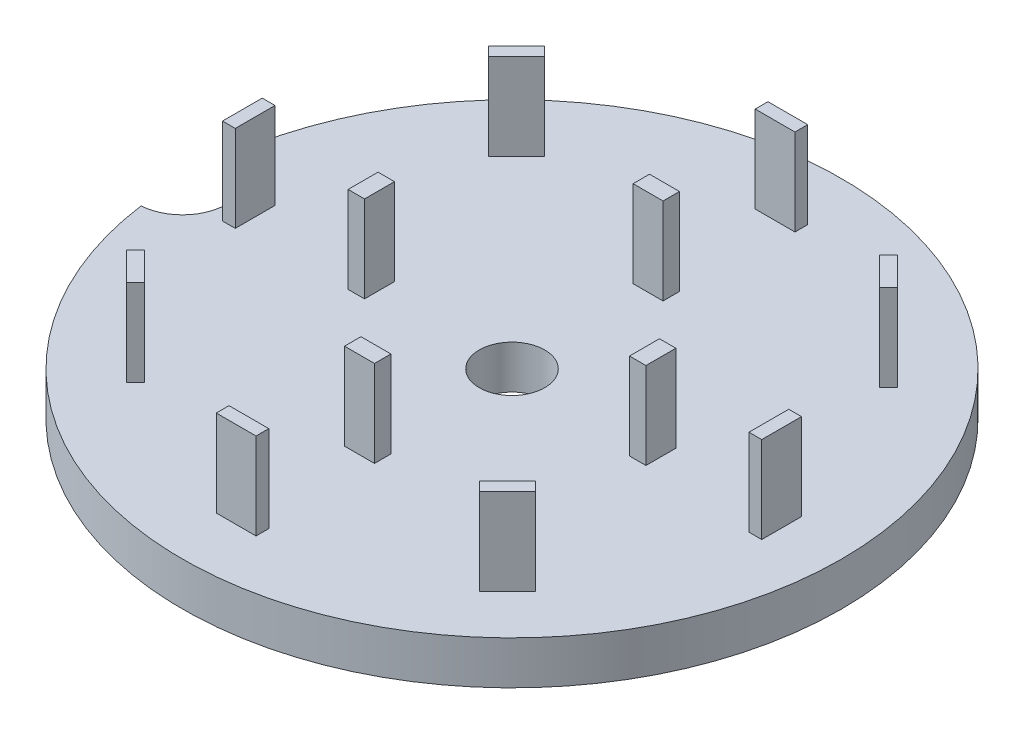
from build123d import *

# Parameters (mm, degrees)
BOSS_EXTRUDE1_DEPTH = 2
SKETCH2_R           = 1.512709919
CUT_EXTRUDE1_DEPTH  = 2
SKETCH3_W           = 0.758589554
SKETCH3_H           = 1.383310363
SKETCH3_W_2         = 1.383310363
SKETCH3_H_2         = 0.758589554
SKETCH3_W_3         = 1.836786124
SKETCH3_H_3         = 0.589442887
SKETCH3_W_4         = 0.589442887
SKETCH3_H_4         = 1.836786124
BOSS_EXTRUDE2_DEPTH = 4


with BuildPart() as part:
    # Sketch1 → Boss-Extrude1 (new body)
    with BuildSketch(Plane(origin=(0, 0, 0), x_dir=(1, 0, 0), z_dir=(0, 1, 0))):
        with BuildLine():
            ThreePointArc((-15.08391484, -2.049555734), (15.222521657, 0), (-15.08391484, 2.049555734))
            ThreePointArc((-15.08391484, 2.049555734), (-13.168284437, 0), (-15.08391484, -2.049555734))
        make_face()
    extrude(amount=BOSS_EXTRUDE1_DEPTH)

    # Sketch2 → Cut-Extrude1 (cut)
    with BuildSketch(Plane(origin=(0, 2, 0), x_dir=(-1, 0, 0), z_dir=(0, 1, 0))):
        with Locations(Location((0, 0, 0), (0, 0, 90))):
            Circle(SKETCH2_R)
    extrude(amount=-CUT_EXTRUDE1_DEPTH, mode=Mode.SUBTRACT)

    # Sketch3 → Boss-Extrude2 (add)
    with BuildSketch(Plane(origin=(0, 2, 0), x_dir=(-1, 0, 0), z_dir=(0, 1, 0))):
        with Locations((-6.581879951, 0.082786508)):
            Rectangle(SKETCH3_W, SKETCH3_H)
        with Locations((-0.082786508, -6.581879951)):
            Rectangle(SKETCH3_W_2, SKETCH3_H_2)
        with Locations((0.082786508, 6.581879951)):
            Rectangle(SKETCH3_W_2, SKETCH3_H_2)
        with Locations((6.581879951, -0.082786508)):
            Rectangle(SKETCH3_W, SKETCH3_H)
        Polygon((-8.360400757, -9.455626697), (-7.943601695, -9.038827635), (-9.242405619, -7.740023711), (-9.659204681, -8.156822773), align=None)
        with Locations((-0.143951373, -12.303112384)):
            Rectangle(SKETCH3_W_3, SKETCH3_H_3)
        with Locations((-12.303112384, 0.143951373)):
            Rectangle(SKETCH3_W_4, SKETCH3_H_4)
        Polygon((-9.455626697, 8.360400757), (-9.038827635, 7.943601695), (-7.740023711, 9.242405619), (-8.156822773, 9.659204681), align=None)
        with Locations((0.143951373, 12.303112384)):
            Rectangle(SKETCH3_W_3, SKETCH3_H_3)
        Polygon((8.360400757, 9.455626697), (7.943601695, 9.038827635), (9.242405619, 7.740023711), (9.659204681, 8.156822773), align=None)
        with Locations((12.303112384, -0.143951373)):
            Rectangle(SKETCH3_W_4, SKETCH3_H_4)
        Polygon((9.455626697, -8.360400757), (9.038827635, -7.943601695), (7.740023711, -9.242405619), (8.156822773, -9.659204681), align=None)
    extrude(amount=BOSS_EXTRUDE2_DEPTH)


solid = part.part
